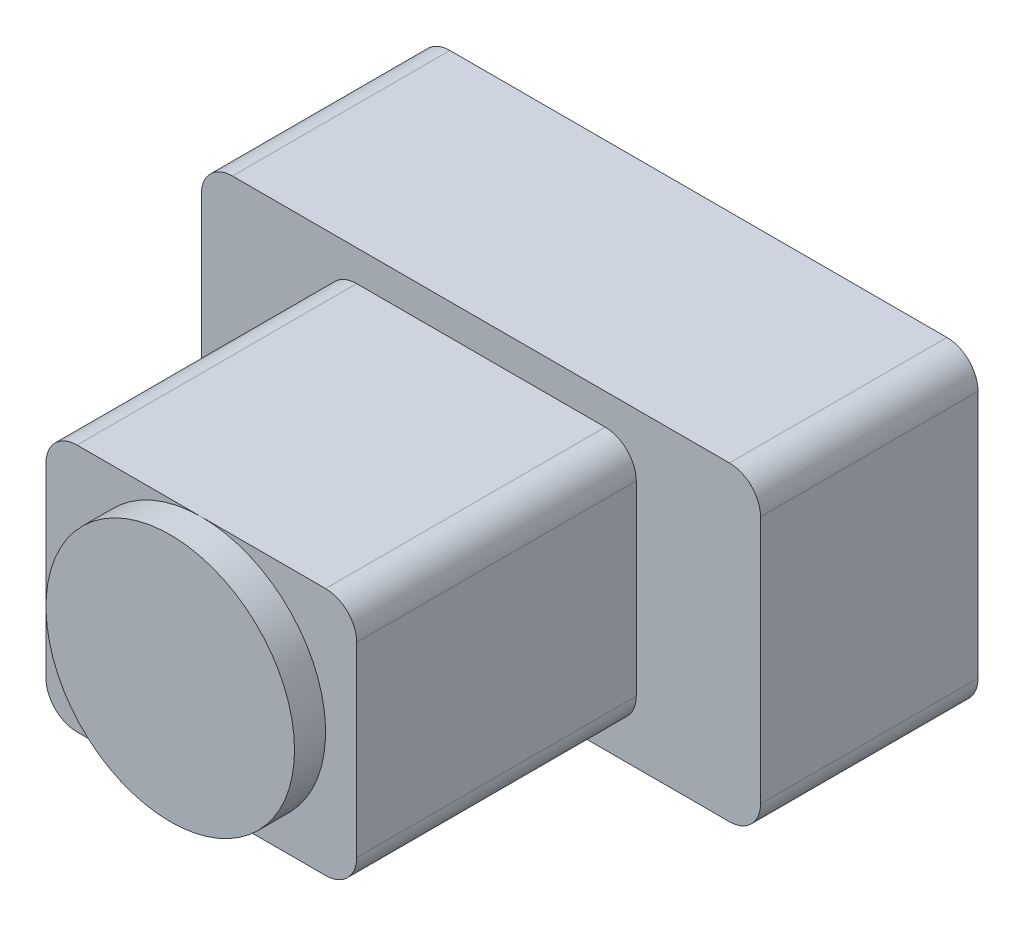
from build123d import *

# Parameters (mm, degrees)
SALIENTE_EXTRUIR1_DEPTH = 35
SALIENTE_EXTRUIR2_DEPTH = 45
CROQUIS4_R              = 20
SALIENTE_EXTRUIR3_DEPTH = 5


with BuildPart() as part:
    # Croquis1 → Saliente-Extruir1 (new body)
    with BuildSketch(Plane.XY):
        with BuildLine():
            Line((-40, 25), (40, 25))
            ThreePointArc((40, 25), (43.535533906, 23.535533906), (45, 20))
            Line((45, 20), (45, -20))
            ThreePointArc((45, -20), (43.535533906, -23.535533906), (40, -25))
            Line((40, -25), (-40, -25))
            ThreePointArc((-40, -25), (-43.535533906, -23.535533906), (-45, -20))
            Line((-45, -20), (-45, 20))
            ThreePointArc((-45, 20), (-43.535533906, 23.535533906), (-40, 25))
        make_face()
    extrude(amount=SALIENTE_EXTRUIR1_DEPTH)

    # Croquis2 → Saliente-Extruir2 (add)
    with BuildSketch(Plane.XY.offset(35)):
        with BuildLine():
            Line((-20, 20), (20, 20))
            ThreePointArc((20, 20), (23.535533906, 18.535533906), (25, 15))
            Line((25, 15), (25, -15))
            ThreePointArc((25, -15), (23.535533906, -18.535533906), (20, -20))
            Line((20, -20), (-20, -20))
            ThreePointArc((-20, -20), (-23.535533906, -18.535533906), (-25, -15))
            Line((-25, -15), (-25, 15))
            ThreePointArc((-25, 15), (-23.535533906, 18.535533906), (-20, 20))
        make_face()
    extrude(amount=SALIENTE_EXTRUIR2_DEPTH)

    # Croquis4 → Saliente-Extruir3 (add)
    with BuildSketch(Plane.XY.offset(80)):
        with Locations(Location((0, 0, 0), (0, 0, 270))):
            Circle(CROQUIS4_R)
    extrude(amount=SALIENTE_EXTRUIR3_DEPTH)


solid = part.part
